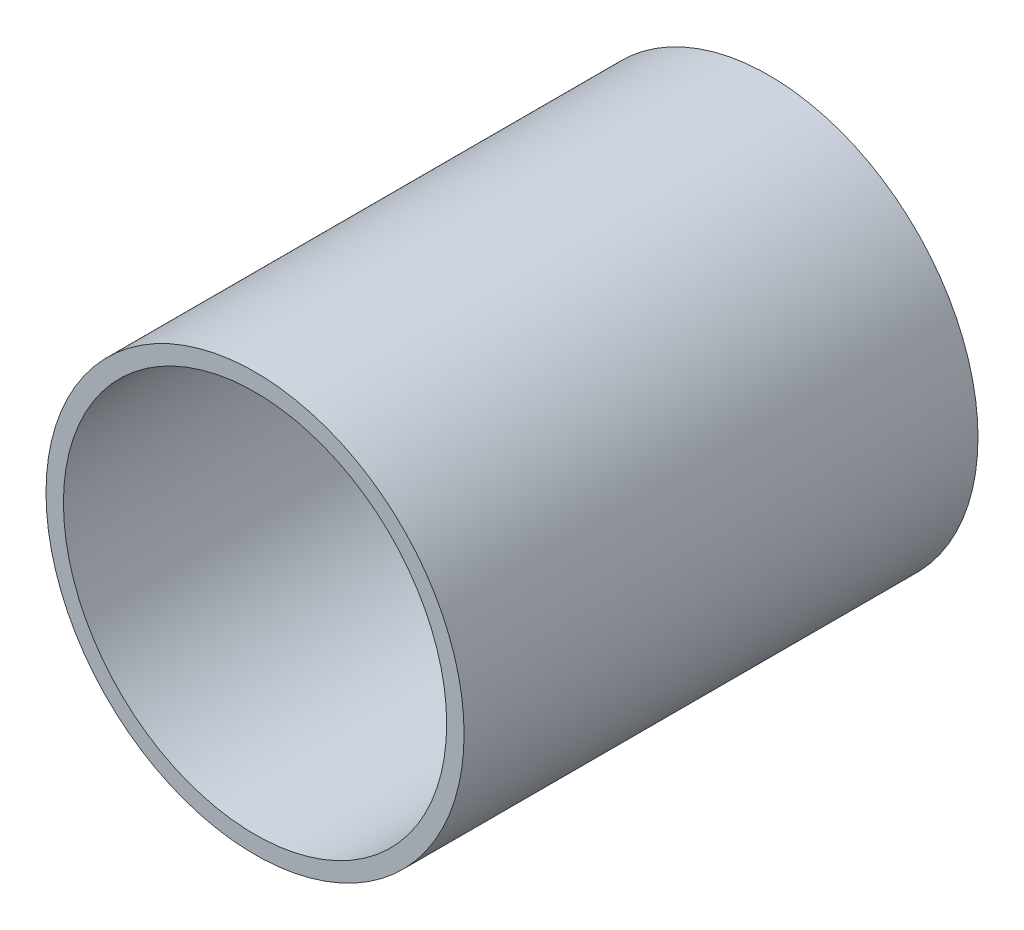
ISO-10303-21;
HEADER;
FILE_DESCRIPTION(('STEP AP214'),'2;1');
FILE_NAME('part.step','',(''),(''),'','','');
FILE_SCHEMA(('AUTOMOTIVE_DESIGN { 1 0 10303 214 1 1 1 1 }'));
ENDSEC;
DATA;
#1=APPLICATION_CONTEXT('core data for automotive mechanical design processes');
#2=APPLICATION_PROTOCOL_DEFINITION('international standard','automotive_design',2000,#1);
#3=PRODUCT_CONTEXT('',#1,'mechanical');
#4=PRODUCT('Part','Part','',(#3));
#5=PRODUCT_RELATED_PRODUCT_CATEGORY('part','',(#4));
#6=PRODUCT_DEFINITION_FORMATION('','',#4);
#7=PRODUCT_DEFINITION_CONTEXT('part definition',#1,'design');
#8=PRODUCT_DEFINITION('design','',#6,#7);
#9=PRODUCT_DEFINITION_SHAPE('','',#8);
#10=(LENGTH_UNIT() NAMED_UNIT(*) SI_UNIT(.MILLI.,.METRE.));
#11=(NAMED_UNIT(*) PLANE_ANGLE_UNIT() SI_UNIT($,.RADIAN.));
#12=(NAMED_UNIT(*) SI_UNIT($,.STERADIAN.) SOLID_ANGLE_UNIT());
#13=UNCERTAINTY_MEASURE_WITH_UNIT(LENGTH_MEASURE(1.E-05),#10,'distance_accuracy_value','');
#14=(GEOMETRIC_REPRESENTATION_CONTEXT(3) GLOBAL_UNCERTAINTY_ASSIGNED_CONTEXT((#13)) GLOBAL_UNIT_ASSIGNED_CONTEXT((#10,
#11,#12)) REPRESENTATION_CONTEXT('',''));
#15=CARTESIAN_POINT('',(0.,0.,0.));
#16=DIRECTION('',(0.,0.,1.));
#17=DIRECTION('',(1.,0.,0.));
#18=AXIS2_PLACEMENT_3D('',#15,#16,#17);
#19=CARTESIAN_POINT('',(0.,0.,29.5));
#20=DIRECTION('',(0.,0.,-1.));
#21=DIRECTION('',(-1.,0.,0.));
#22=AXIS2_PLACEMENT_3D('',#19,#20,#21);
#23=CYLINDRICAL_SURFACE('',#22,11.);
#24=CARTESIAN_POINT('',(0.,0.,0.));
#25=DIRECTION('',(0.,0.,-1.));
#26=DIRECTION('',(-1.,0.,0.));
#27=AXIS2_PLACEMENT_3D('',#24,#25,#26);
#28=CIRCLE('',#27,11.);
#29=CARTESIAN_POINT('',(-11.,0.,0.));
#30=VERTEX_POINT('',#29);
#31=EDGE_CURVE('E26',#30,#30,#28,.T.);
#32=ORIENTED_EDGE('',*,*,#31,.T.);
#33=EDGE_LOOP('',(#32));
#34=FACE_BOUND('',#33,.T.);
#35=CARTESIAN_POINT('',(0.,0.,29.5));
#36=DIRECTION('',(0.,0.,-1.));
#37=DIRECTION('',(-1.,0.,0.));
#38=AXIS2_PLACEMENT_3D('',#35,#36,#37);
#39=CIRCLE('',#38,11.);
#40=CARTESIAN_POINT('',(-11.,0.,29.5));
#41=VERTEX_POINT('',#40);
#42=EDGE_CURVE('E17',#41,#41,#39,.T.);
#43=ORIENTED_EDGE('',*,*,#42,.F.);
#44=EDGE_LOOP('',(#43));
#45=FACE_BOUND('',#44,.T.);
#46=ADVANCED_FACE('F14',(#34,#45),#23,.F.);
#47=CARTESIAN_POINT('',(0.,0.,29.5));
#48=DIRECTION('',(0.,0.,1.));
#49=DIRECTION('',(1.,0.,0.));
#50=AXIS2_PLACEMENT_3D('',#47,#48,#49);
#51=PLANE('',#50);
#52=ORIENTED_EDGE('',*,*,#42,.T.);
#53=EDGE_LOOP('',(#52));
#54=FACE_BOUND('',#53,.T.);
#55=CARTESIAN_POINT('',(0.,0.,29.5));
#56=DIRECTION('',(0.,0.,-1.));
#57=DIRECTION('',(-1.,0.,0.));
#58=AXIS2_PLACEMENT_3D('',#55,#56,#57);
#59=CIRCLE('',#58,12.);
#60=CARTESIAN_POINT('',(-12.,0.,29.5));
#61=VERTEX_POINT('',#60);
#62=EDGE_CURVE('E21',#61,#61,#59,.T.);
#63=ORIENTED_EDGE('',*,*,#62,.F.);
#64=EDGE_LOOP('',(#63));
#65=FACE_BOUND('',#64,.T.);
#66=ADVANCED_FACE('F34',(#54,#65),#51,.T.);
#67=CARTESIAN_POINT('',(0.,0.,0.));
#68=DIRECTION('',(0.,0.,1.));
#69=DIRECTION('',(1.,0.,0.));
#70=AXIS2_PLACEMENT_3D('',#67,#68,#69);
#71=PLANE('',#70);
#72=ORIENTED_EDGE('',*,*,#31,.F.);
#73=EDGE_LOOP('',(#72));
#74=FACE_BOUND('',#73,.T.);
#75=CARTESIAN_POINT('',(0.,0.,0.));
#76=DIRECTION('',(0.,0.,-1.));
#77=DIRECTION('',(-1.,0.,0.));
#78=AXIS2_PLACEMENT_3D('',#75,#76,#77);
#79=CIRCLE('',#78,12.);
#80=CARTESIAN_POINT('',(-12.,0.,0.));
#81=VERTEX_POINT('',#80);
#82=EDGE_CURVE('E10',#81,#81,#79,.F.);
#83=ORIENTED_EDGE('',*,*,#82,.F.);
#84=EDGE_LOOP('',(#83));
#85=FACE_BOUND('',#84,.T.);
#86=ADVANCED_FACE('F42',(#74,#85),#71,.F.);
#87=CARTESIAN_POINT('',(0.,0.,29.5));
#88=DIRECTION('',(0.,0.,-1.));
#89=DIRECTION('',(-1.,0.,0.));
#90=AXIS2_PLACEMENT_3D('',#87,#88,#89);
#91=CYLINDRICAL_SURFACE('',#90,12.);
#92=ORIENTED_EDGE('',*,*,#82,.T.);
#93=EDGE_LOOP('',(#92));
#94=FACE_BOUND('',#93,.T.);
#95=ORIENTED_EDGE('',*,*,#62,.T.);
#96=EDGE_LOOP('',(#95));
#97=FACE_BOUND('',#96,.T.);
#98=ADVANCED_FACE('F43',(#94,#97),#91,.T.);
#99=CLOSED_SHELL('',(#46,#66,#86,#98));
#100=MANIFOLD_SOLID_BREP('B1',#99);
#101=ADVANCED_BREP_SHAPE_REPRESENTATION('',(#18,#100),#14);
#102=SHAPE_DEFINITION_REPRESENTATION(#9,#101);
ENDSEC;
END-ISO-10303-21;
